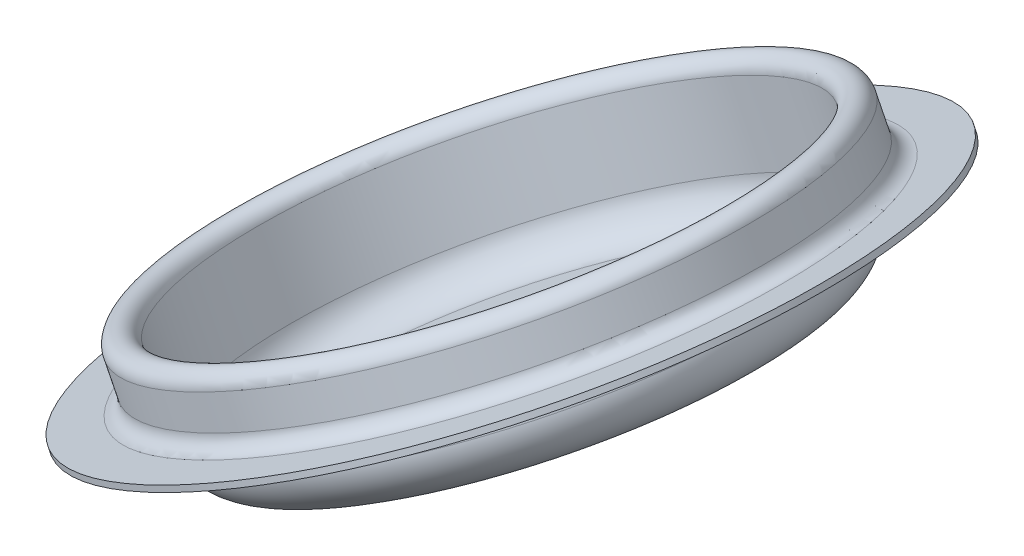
from build123d import *


with BuildPart() as part:
    # Esquisse1 → R_volution1 (revolve)
    with BuildSketch(Plane.XY):
        with BuildLine():
            Line((3.902437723, 127.625156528), (7.25247449, 129.310313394))
            Line((7.25247449, 129.310313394), (7.477162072, 128.863641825))
            Line((7.477162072, 128.863641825), (4.127125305, 127.178484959))
            ThreePointArc((4.127125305, 127.178484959), (2.791336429, 127.080306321), (1.777368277, 127.955428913))
            Line((1.777368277, 127.955428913), (0.541586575, 130.412122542))
            ThreePointArc((0.541586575, 130.412122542), (-0.465452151, 130.745098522), (-0.798428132, 129.738059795))
            Line((-0.798428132, 129.738059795), (2.122510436, 123.9313294))
            ThreePointArc((2.122510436, 123.9313294), (2.318867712, 121.259751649), (0.568622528, 119.231815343))
            Line((0.568622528, 119.231815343), (-14.618210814, 111.592437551))
            Line((-14.618210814, 111.592437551), (-14.842898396, 112.03910912))
            Line((-14.842898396, 112.03910912), (0.343934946, 119.678486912))
            ThreePointArc((0.343934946, 119.678486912), (1.844145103, 121.416718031), (1.675838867, 123.706641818))
            Line((1.675838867, 123.706641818), (-1.2450997, 129.513372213))
            ThreePointArc((-1.2450997, 129.513372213), (-0.690139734, 131.191770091), (0.988258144, 130.636810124))
            Line((0.988258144, 130.636810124), (2.224039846, 128.180116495))
            ThreePointArc((2.224039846, 128.180116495), (2.948302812, 127.55502893), (3.902437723, 127.625156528))
        make_face()
    revolve(axis=Axis((18.873756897, 39.448220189, 0), (-0.4493751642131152, 0.8933431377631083, 0)))


solid = part.part
